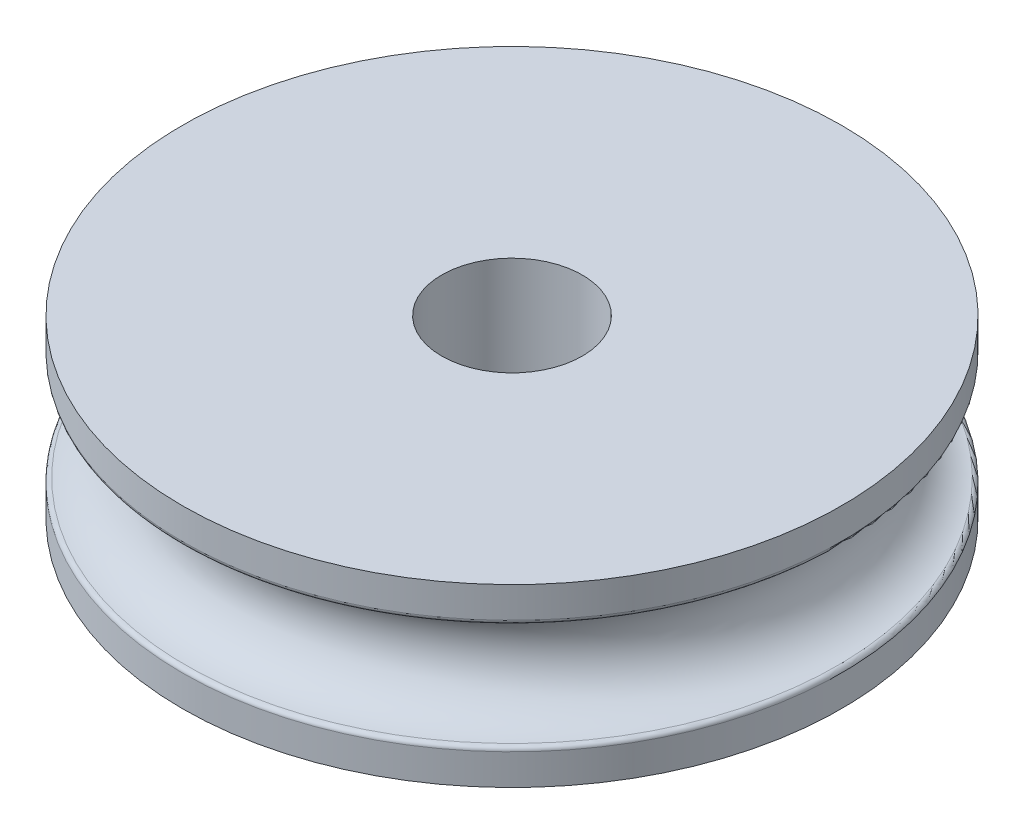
from build123d import *

# Parameters (mm, degrees)
CROQUIS2_R            = 1.6
CORTAR_EXTRUIR1_DEPTH = 12.335784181


with BuildPart() as part:
    # Croquis1 → Revoluci_n1 (revolve)
    with BuildSketch(Plane.XY, mode=Mode.PRIVATE) as revoluci_n1_sk:
        with BuildLine():
            Line((7.5, 3.29614814), (7.5, 4))
            Line((7.5, 4), (0, 4))
            Line((0, 4), (0, 0))
            Line((0, 0), (7.5, 0))
            Line((7.5, 0), (7.5, 0.70385186))
            ThreePointArc((7.5, 0.70385186), (7.473379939, 0.771788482), (7.407692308, 0.803555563))
            ThreePointArc((7.407692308, 0.803555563), (6.3, 2), (7.407692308, 3.196444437))
            ThreePointArc((7.407692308, 3.196444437), (7.473379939, 3.228211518), (7.5, 3.29614814))
        make_face()
    revolve(revoluci_n1_sk.sketch.rotate(Axis((0, 0, 0), (0, 1, 0)), 90), axis=Axis((0, 0, 0), (0, 1, 0)))

    # Croquis2 → Cortar-Extruir1 (cut, through all)
    with BuildSketch(Plane(origin=(0, 4, 0), x_dir=(1, 0, 0), z_dir=(0, 1, 0))):
        with Locations(Location((0, 0, 0), (0, 0, 270))):
            Circle(CROQUIS2_R)
    extrude(amount=-CORTAR_EXTRUIR1_DEPTH, mode=Mode.SUBTRACT)


solid = part.part
